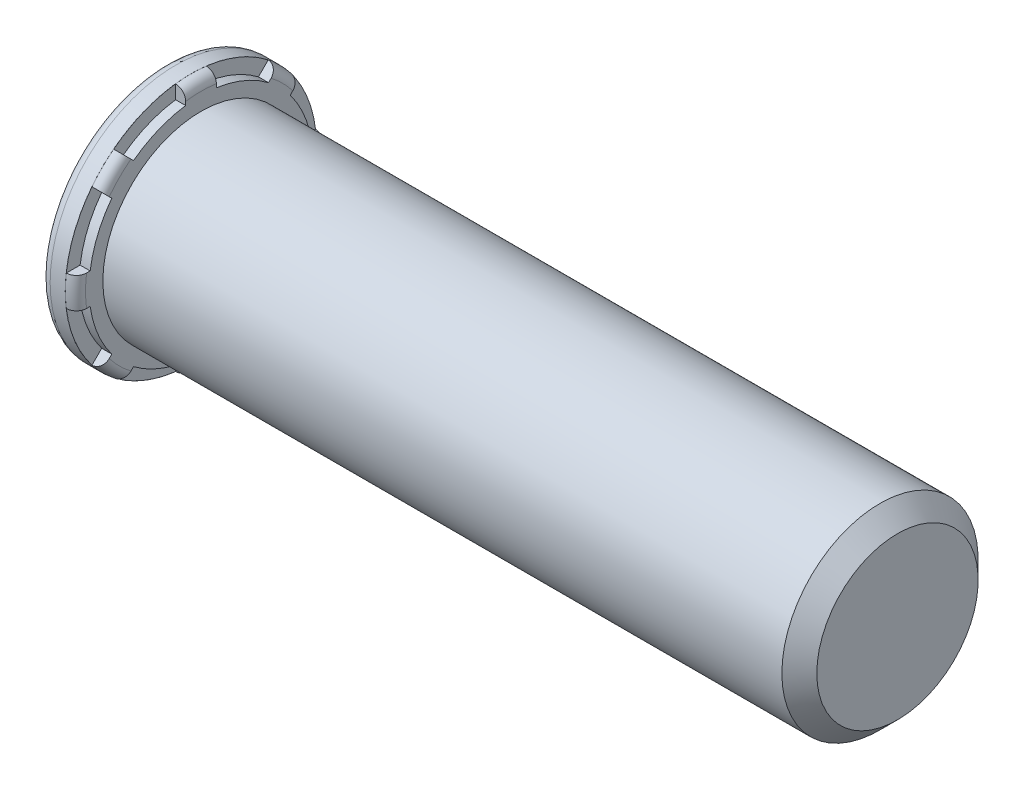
from build123d import *

# Parameters (mm, degrees)
RIBCUT_START     = -0.2561
RIBCUT_DEPTH     = 0.2561
RIBCUTSPAT_COUNT = 8
RIBCUTSPAT_ANGLE = 315


with BuildPart() as part:
    # BodySke → BaseBody (revolve)
    with BuildSketch(Plane.XY, mode=Mode.PRIVATE) as basebody_sk:
        with BuildLine():
            Line((-0.64, 2.944), (-0.64, 0))
            Line((-0.64, 0), (18, 0))
            Line((18, 0), (18, 2.055))
            Line((18, 2.055), (17.555, 2.5))
            Line((17.555, 2.5), (0.25854, 2.5))
            Line((0.25854, 2.5), (0.25854, 2.94146))
            ThreePointArc((0.25854, 2.94146), (0.183559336, 3.122479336), (0.00254, 3.19746))
            Line((0.00254, 3.19746), (0, 3.19746))
            Line((0, 3.19746), (0, 3.2))
            Line((0, 3.2), (-0.384, 3.2))
            ThreePointArc((-0.384, 3.2), (-0.565019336, 3.125019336), (-0.64, 2.944))
        make_face()
    revolve(basebody_sk.sketch.rotate(Axis((0, 0, 0), (1, 0, 0)), 90), axis=Axis((0, 0, 0), (1, 0, 0)))

    # RibCutSke → RibCut (cut)
    with BuildSketch(Plane(origin=(0.25854, 1.794401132, -0.090952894), x_dir=(0, 0, -1), z_dir=(1, 0, 0)).offset(RIBCUT_START)):
        with BuildLine():
            Line((0.300133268, 1.028638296), (0.300133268, 1.381610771))
            ThreePointArc((0.300133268, 1.381610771), (1.133634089, 1.162013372), (1.878286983, 0.7279181))
            Line((1.878286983, 0.7279181), (1.628697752, 0.478328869))
            ThreePointArc((1.628697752, 0.478328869), (0.999694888, 0.838655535), (0.300133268, 1.028638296))
        make_face()
    ribcut = extrude(amount=RIBCUT_DEPTH, mode=Mode.SUBTRACT)

    # RibCutsPat: RibCut ×8 about axis
    ribcutspat_axis = Axis((0, 0, 0), (1, 0, 0))
    for i in range(1, RIBCUTSPAT_COUNT):
        add(ribcut.rotate(ribcutspat_axis, i * RIBCUTSPAT_ANGLE / (RIBCUTSPAT_COUNT - 1)), mode=Mode.SUBTRACT)


solid = part.part
